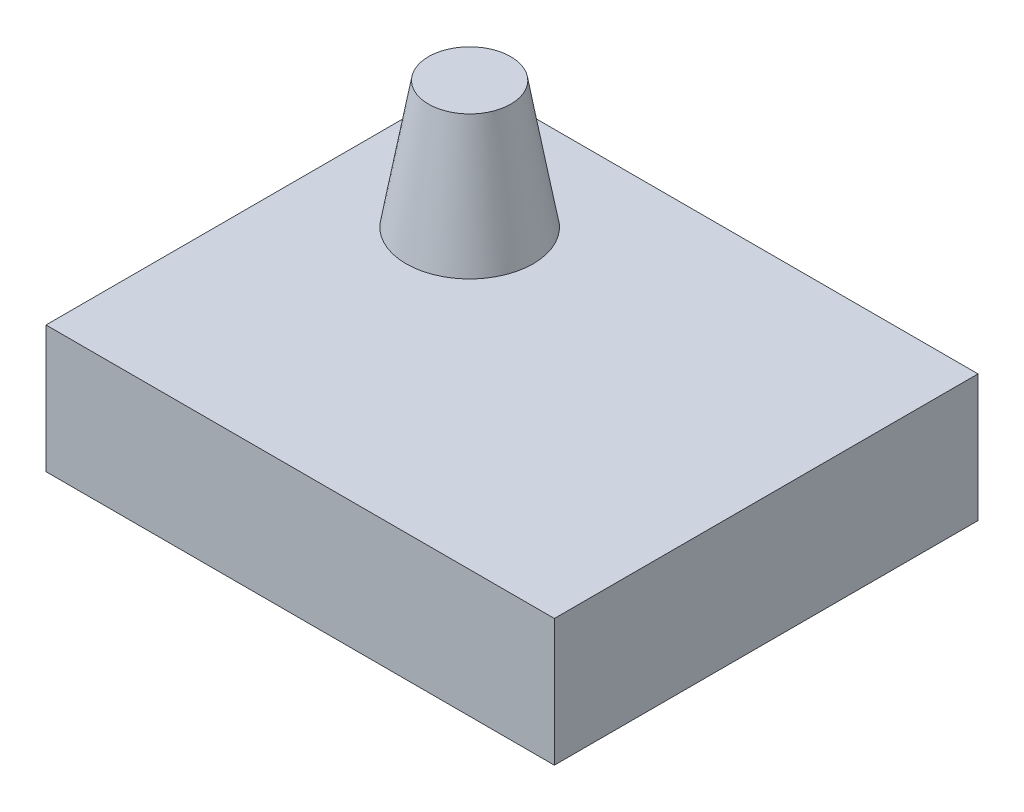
ISO-10303-21;
HEADER;
FILE_DESCRIPTION(('STEP AP214'),'2;1');
FILE_NAME('part.step','',(''),(''),'','','');
FILE_SCHEMA(('AUTOMOTIVE_DESIGN { 1 0 10303 214 1 1 1 1 }'));
ENDSEC;
DATA;
#1=APPLICATION_CONTEXT('core data for automotive mechanical design processes');
#2=APPLICATION_PROTOCOL_DEFINITION('international standard','automotive_design',2000,#1);
#3=PRODUCT_CONTEXT('',#1,'mechanical');
#4=PRODUCT('Part','Part','',(#3));
#5=PRODUCT_RELATED_PRODUCT_CATEGORY('part','',(#4));
#6=PRODUCT_DEFINITION_FORMATION('','',#4);
#7=PRODUCT_DEFINITION_CONTEXT('part definition',#1,'design');
#8=PRODUCT_DEFINITION('design','',#6,#7);
#9=PRODUCT_DEFINITION_SHAPE('','',#8);
#10=(LENGTH_UNIT() NAMED_UNIT(*) SI_UNIT(.MILLI.,.METRE.));
#11=(NAMED_UNIT(*) PLANE_ANGLE_UNIT() SI_UNIT($,.RADIAN.));
#12=(NAMED_UNIT(*) SI_UNIT($,.STERADIAN.) SOLID_ANGLE_UNIT());
#13=UNCERTAINTY_MEASURE_WITH_UNIT(LENGTH_MEASURE(1.E-05),#10,'distance_accuracy_value','');
#14=(GEOMETRIC_REPRESENTATION_CONTEXT(3) GLOBAL_UNCERTAINTY_ASSIGNED_CONTEXT((#13)) GLOBAL_UNIT_ASSIGNED_CONTEXT((#10,
#11,#12)) REPRESENTATION_CONTEXT('',''));
#15=CARTESIAN_POINT('',(0.,0.,0.));
#16=DIRECTION('',(0.,0.,1.));
#17=DIRECTION('',(1.,0.,0.));
#18=AXIS2_PLACEMENT_3D('',#15,#16,#17);
#19=CARTESIAN_POINT('',(-60.,30.,-50.));
#20=DIRECTION('',(1.,0.,0.));
#21=DIRECTION('',(0.,0.,-1.));
#22=AXIS2_PLACEMENT_3D('',#19,#20,#21);
#23=PLANE('',#22);
#24=DIRECTION('',(0.,0.,1.));
#25=VECTOR('',#24,1.);
#26=CARTESIAN_POINT('',(-60.,0.,-50.));
#27=LINE('',#26,#25);
#28=CARTESIAN_POINT('',(-60.,0.,-50.));
#29=VERTEX_POINT('',#28);
#30=CARTESIAN_POINT('',(-60.,0.,50.));
#31=VERTEX_POINT('',#30);
#32=EDGE_CURVE('E101',#29,#31,#27,.T.);
#33=ORIENTED_EDGE('',*,*,#32,.T.);
#34=DIRECTION('',(0.,-1.,0.));
#35=VECTOR('',#34,1.);
#36=CARTESIAN_POINT('',(-60.,30.,50.));
#37=LINE('',#36,#35);
#38=CARTESIAN_POINT('',(-60.,30.,50.));
#39=VERTEX_POINT('',#38);
#40=EDGE_CURVE('E43',#39,#31,#37,.T.);
#41=ORIENTED_EDGE('',*,*,#40,.F.);
#42=DIRECTION('',(0.,0.,1.));
#43=VECTOR('',#42,1.);
#44=CARTESIAN_POINT('',(-60.,30.,-50.));
#45=LINE('',#44,#43);
#46=CARTESIAN_POINT('',(-60.,30.,-50.));
#47=VERTEX_POINT('',#46);
#48=EDGE_CURVE('E87',#47,#39,#45,.T.);
#49=ORIENTED_EDGE('',*,*,#48,.F.);
#50=DIRECTION('',(0.,-1.,0.));
#51=VECTOR('',#50,1.);
#52=CARTESIAN_POINT('',(-60.,30.,-50.));
#53=LINE('',#52,#51);
#54=EDGE_CURVE('E97',#47,#29,#53,.T.);
#55=ORIENTED_EDGE('',*,*,#54,.T.);
#56=EDGE_LOOP('',(#33,#41,#49,#55));
#57=FACE_BOUND('',#56,.T.);
#58=ADVANCED_FACE('F35',(#57),#23,.F.);
#59=CARTESIAN_POINT('',(60.,30.,50.));
#60=DIRECTION('',(0.,0.,-1.));
#61=DIRECTION('',(-1.,0.,0.));
#62=AXIS2_PLACEMENT_3D('',#59,#60,#61);
#63=PLANE('',#62);
#64=DIRECTION('',(1.,0.,0.));
#65=VECTOR('',#64,1.);
#66=CARTESIAN_POINT('',(60.,0.,50.));
#67=LINE('',#66,#65);
#68=CARTESIAN_POINT('',(60.,0.,50.));
#69=VERTEX_POINT('',#68);
#70=EDGE_CURVE('E92',#31,#69,#67,.T.);
#71=ORIENTED_EDGE('',*,*,#70,.T.);
#72=DIRECTION('',(0.,-1.,0.));
#73=VECTOR('',#72,1.);
#74=CARTESIAN_POINT('',(60.,30.,50.));
#75=LINE('',#74,#73);
#76=CARTESIAN_POINT('',(60.,30.,50.));
#77=VERTEX_POINT('',#76);
#78=EDGE_CURVE('E90',#77,#69,#75,.T.);
#79=ORIENTED_EDGE('',*,*,#78,.F.);
#80=DIRECTION('',(1.,0.,0.));
#81=VECTOR('',#80,1.);
#82=CARTESIAN_POINT('',(60.,30.,50.));
#83=LINE('',#82,#81);
#84=EDGE_CURVE('E82',#39,#77,#83,.T.);
#85=ORIENTED_EDGE('',*,*,#84,.F.);
#86=ORIENTED_EDGE('',*,*,#40,.T.);
#87=EDGE_LOOP('',(#71,#79,#85,#86));
#88=FACE_BOUND('',#87,.T.);
#89=ADVANCED_FACE('F91',(#88),#63,.F.);
#90=CARTESIAN_POINT('',(60.,30.,-50.));
#91=DIRECTION('',(-1.,0.,0.));
#92=DIRECTION('',(0.,0.,1.));
#93=AXIS2_PLACEMENT_3D('',#90,#91,#92);
#94=PLANE('',#93);
#95=DIRECTION('',(0.,0.,-1.));
#96=VECTOR('',#95,1.);
#97=CARTESIAN_POINT('',(60.,0.,-50.));
#98=LINE('',#97,#96);
#99=CARTESIAN_POINT('',(60.,0.,-50.));
#100=VERTEX_POINT('',#99);
#101=EDGE_CURVE('E68',#69,#100,#98,.T.);
#102=ORIENTED_EDGE('',*,*,#101,.T.);
#103=DIRECTION('',(0.,-1.,0.));
#104=VECTOR('',#103,1.);
#105=CARTESIAN_POINT('',(60.,30.,-50.));
#106=LINE('',#105,#104);
#107=CARTESIAN_POINT('',(60.,30.,-50.));
#108=VERTEX_POINT('',#107);
#109=EDGE_CURVE('E93',#108,#100,#106,.T.);
#110=ORIENTED_EDGE('',*,*,#109,.F.);
#111=DIRECTION('',(0.,0.,-1.));
#112=VECTOR('',#111,1.);
#113=CARTESIAN_POINT('',(60.,30.,-50.));
#114=LINE('',#113,#112);
#115=EDGE_CURVE('E85',#77,#108,#114,.T.);
#116=ORIENTED_EDGE('',*,*,#115,.F.);
#117=ORIENTED_EDGE('',*,*,#78,.T.);
#118=EDGE_LOOP('',(#102,#110,#116,#117));
#119=FACE_BOUND('',#118,.T.);
#120=ADVANCED_FACE('F95',(#119),#94,.F.);
#121=CARTESIAN_POINT('',(60.,30.,-50.));
#122=DIRECTION('',(0.,0.,1.));
#123=DIRECTION('',(1.,0.,0.));
#124=AXIS2_PLACEMENT_3D('',#121,#122,#123);
#125=PLANE('',#124);
#126=DIRECTION('',(-1.,0.,0.));
#127=VECTOR('',#126,1.);
#128=CARTESIAN_POINT('',(60.,0.,-50.));
#129=LINE('',#128,#127);
#130=EDGE_CURVE('E74',#100,#29,#129,.T.);
#131=ORIENTED_EDGE('',*,*,#130,.T.);
#132=ORIENTED_EDGE('',*,*,#54,.F.);
#133=DIRECTION('',(-1.,0.,0.));
#134=VECTOR('',#133,1.);
#135=CARTESIAN_POINT('',(60.,30.,-50.));
#136=LINE('',#135,#134);
#137=EDGE_CURVE('E51',#108,#47,#136,.T.);
#138=ORIENTED_EDGE('',*,*,#137,.F.);
#139=ORIENTED_EDGE('',*,*,#109,.T.);
#140=EDGE_LOOP('',(#131,#132,#138,#139));
#141=FACE_BOUND('',#140,.T.);
#142=ADVANCED_FACE('F123',(#141),#125,.F.);
#143=CARTESIAN_POINT('',(0.,30.,0.));
#144=DIRECTION('',(0.,-1.,0.));
#145=DIRECTION('',(0.,0.,-1.));
#146=AXIS2_PLACEMENT_3D('',#143,#144,#145);
#147=PLANE('',#146);
#148=CARTESIAN_POINT('',(-30.,30.,-20.));
#149=DIRECTION('',(0.,-1.,0.));
#150=DIRECTION('',(0.,0.,-1.));
#151=AXIS2_PLACEMENT_3D('',#148,#149,#150);
#152=CIRCLE('',#151,15.);
#153=CARTESIAN_POINT('',(-30.,30.,-35.));
#154=VERTEX_POINT('',#153);
#155=EDGE_CURVE('E11',#154,#154,#152,.F.);
#156=ORIENTED_EDGE('',*,*,#155,.F.);
#157=EDGE_LOOP('',(#156));
#158=FACE_BOUND('',#157,.T.);
#159=ORIENTED_EDGE('',*,*,#48,.T.);
#160=ORIENTED_EDGE('',*,*,#84,.T.);
#161=ORIENTED_EDGE('',*,*,#115,.T.);
#162=ORIENTED_EDGE('',*,*,#137,.T.);
#163=EDGE_LOOP('',(#159,#160,#161,#162));
#164=FACE_BOUND('',#163,.T.);
#165=ADVANCED_FACE('F83',(#158,#164),#147,.F.);
#166=CARTESIAN_POINT('',(0.,0.,0.));
#167=DIRECTION('',(0.,-1.,0.));
#168=DIRECTION('',(0.,0.,-1.));
#169=AXIS2_PLACEMENT_3D('',#166,#167,#168);
#170=PLANE('',#169);
#171=ORIENTED_EDGE('',*,*,#32,.F.);
#172=ORIENTED_EDGE('',*,*,#130,.F.);
#173=ORIENTED_EDGE('',*,*,#101,.F.);
#174=ORIENTED_EDGE('',*,*,#70,.F.);
#175=EDGE_LOOP('',(#171,#172,#173,#174));
#176=FACE_BOUND('',#175,.T.);
#177=ADVANCED_FACE('F112',(#176),#170,.T.);
#178=CARTESIAN_POINT('',(-30.,30.,-20.));
#179=DIRECTION('',(0.,-1.,0.));
#180=DIRECTION('',(0.,0.,1.));
#181=AXIS2_PLACEMENT_3D('',#178,#179,#180);
#182=CONICAL_SURFACE('',#181,15.,0.174532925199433);
#183=CARTESIAN_POINT('',(-30.,60.,-20.));
#184=DIRECTION('',(0.,1.,0.));
#185=DIRECTION('',(0.,0.,1.));
#186=AXIS2_PLACEMENT_3D('',#183,#184,#185);
#187=CIRCLE('',#186,9.71019057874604);
#188=CARTESIAN_POINT('',(-30.,60.,-10.289809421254));
#189=VERTEX_POINT('',#188);
#190=EDGE_CURVE('E104',#189,#189,#187,.T.);
#191=ORIENTED_EDGE('',*,*,#190,.F.);
#192=EDGE_LOOP('',(#191));
#193=FACE_BOUND('',#192,.T.);
#194=ORIENTED_EDGE('',*,*,#155,.T.);
#195=EDGE_LOOP('',(#194));
#196=FACE_BOUND('',#195,.T.);
#197=ADVANCED_FACE('F114',(#193,#196),#182,.T.);
#198=CARTESIAN_POINT('',(-30.,60.,-20.));
#199=DIRECTION('',(0.,1.,0.));
#200=DIRECTION('',(0.,0.,1.));
#201=AXIS2_PLACEMENT_3D('',#198,#199,#200);
#202=PLANE('',#201);
#203=ORIENTED_EDGE('',*,*,#190,.T.);
#204=EDGE_LOOP('',(#203));
#205=FACE_BOUND('',#204,.T.);
#206=ADVANCED_FACE('F120',(#205),#202,.T.);
#207=CLOSED_SHELL('',(#58,#89,#120,#142,#165,#177,#197,#206));
#208=MANIFOLD_SOLID_BREP('B2',#207);
#209=ADVANCED_BREP_SHAPE_REPRESENTATION('',(#18,#208),#14);
#210=SHAPE_DEFINITION_REPRESENTATION(#9,#209);
ENDSEC;
END-ISO-10303-21;
